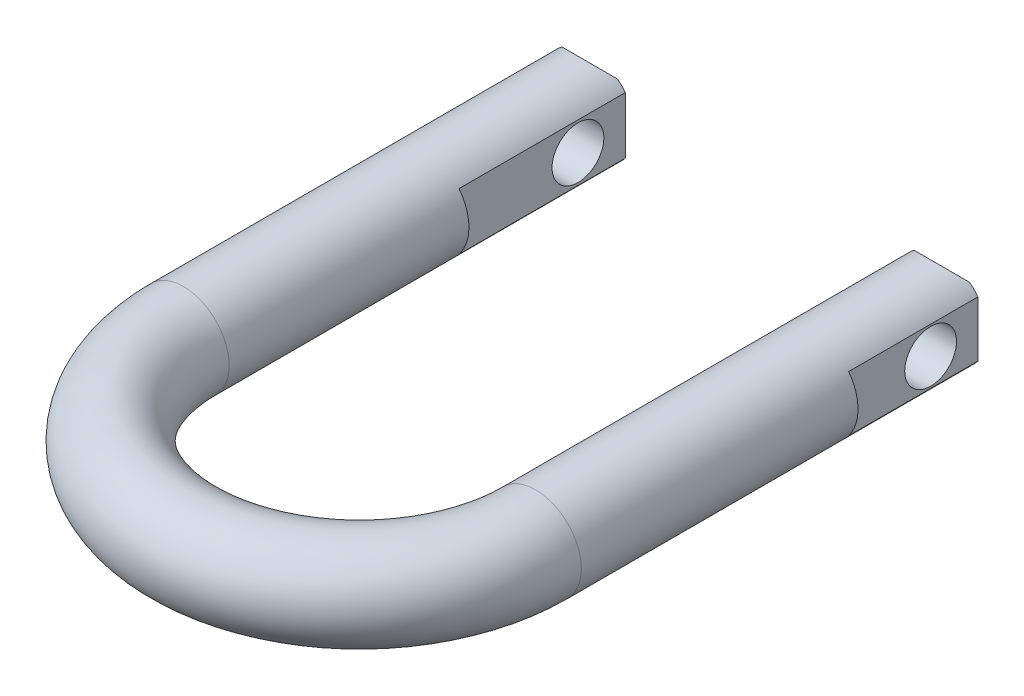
ISO-10303-21;
HEADER;
FILE_DESCRIPTION(('STEP AP214'),'2;1');
FILE_NAME('part.step','',(''),(''),'','','');
FILE_SCHEMA(('AUTOMOTIVE_DESIGN { 1 0 10303 214 1 1 1 1 }'));
ENDSEC;
DATA;
#1=APPLICATION_CONTEXT('core data for automotive mechanical design processes');
#2=APPLICATION_PROTOCOL_DEFINITION('international standard','automotive_design',2000,#1);
#3=PRODUCT_CONTEXT('',#1,'mechanical');
#4=PRODUCT('Part','Part','',(#3));
#5=PRODUCT_RELATED_PRODUCT_CATEGORY('part','',(#4));
#6=PRODUCT_DEFINITION_FORMATION('','',#4);
#7=PRODUCT_DEFINITION_CONTEXT('part definition',#1,'design');
#8=PRODUCT_DEFINITION('design','',#6,#7);
#9=PRODUCT_DEFINITION_SHAPE('','',#8);
#10=(LENGTH_UNIT() NAMED_UNIT(*) SI_UNIT(.MILLI.,.METRE.));
#11=(NAMED_UNIT(*) PLANE_ANGLE_UNIT() SI_UNIT($,.RADIAN.));
#12=(NAMED_UNIT(*) SI_UNIT($,.STERADIAN.) SOLID_ANGLE_UNIT());
#13=UNCERTAINTY_MEASURE_WITH_UNIT(LENGTH_MEASURE(1.E-05),#10,'distance_accuracy_value','');
#14=(GEOMETRIC_REPRESENTATION_CONTEXT(3) GLOBAL_UNCERTAINTY_ASSIGNED_CONTEXT((#13)) GLOBAL_UNIT_ASSIGNED_CONTEXT((#10,
#11,#12)) REPRESENTATION_CONTEXT('',''));
#15=CARTESIAN_POINT('',(0.,0.,0.));
#16=DIRECTION('',(0.,0.,1.));
#17=DIRECTION('',(1.,0.,0.));
#18=AXIS2_PLACEMENT_3D('',#15,#16,#17);
#19=CARTESIAN_POINT('',(48.26,0.,0.));
#20=DIRECTION('',(1.,0.,0.));
#21=DIRECTION('',(0.,0.,-1.));
#22=AXIS2_PLACEMENT_3D('',#19,#20,#21);
#23=CYLINDRICAL_SURFACE('',#22,8.9);
#24=CARTESIAN_POINT('',(73.0000000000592,0.,0.));
#25=DIRECTION('',(-1.,0.,0.));
#26=DIRECTION('',(0.,0.,1.));
#27=AXIS2_PLACEMENT_3D('',#24,#25,#26);
#28=CIRCLE('',#27,8.9);
#29=CARTESIAN_POINT('',(73.0000000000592,0.,8.9));
#30=VERTEX_POINT('',#29);
#31=EDGE_CURVE('E406',#30,#30,#28,.T.);
#32=ORIENTED_EDGE('',*,*,#31,.F.);
#33=EDGE_LOOP('',(#32));
#34=FACE_BOUND('',#33,.T.);
#35=CARTESIAN_POINT('',(48.26,0.,0.));
#36=DIRECTION('',(1.,0.,0.));
#37=DIRECTION('',(0.,0.,-1.));
#38=AXIS2_PLACEMENT_3D('',#35,#36,#37);
#39=CIRCLE('',#38,8.9);
#40=CARTESIAN_POINT('',(48.26,0.,-8.90000000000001));
#41=VERTEX_POINT('',#40);
#42=EDGE_CURVE('E18',#41,#41,#39,.T.);
#43=ORIENTED_EDGE('',*,*,#42,.F.);
#44=EDGE_LOOP('',(#43));
#45=FACE_BOUND('',#44,.T.);
#46=ADVANCED_FACE('F14',(#34,#45),#23,.F.);
#47=CARTESIAN_POINT('',(-48.26,0.,0.));
#48=DIRECTION('',(-1.,0.,0.));
#49=DIRECTION('',(0.,0.,1.));
#50=AXIS2_PLACEMENT_3D('',#47,#48,#49);
#51=CYLINDRICAL_SURFACE('',#50,8.9);
#52=CARTESIAN_POINT('',(-48.26,0.,0.));
#53=DIRECTION('',(-1.,0.,0.));
#54=DIRECTION('',(0.,0.,1.));
#55=AXIS2_PLACEMENT_3D('',#52,#53,#54);
#56=CIRCLE('',#55,8.9);
#57=CARTESIAN_POINT('',(-48.26,0.,8.89999999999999));
#58=VERTEX_POINT('',#57);
#59=EDGE_CURVE('E129',#58,#58,#56,.F.);
#60=ORIENTED_EDGE('',*,*,#59,.T.);
#61=EDGE_LOOP('',(#60));
#62=FACE_BOUND('',#61,.T.);
#63=CARTESIAN_POINT('',(-73.0000000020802,0.,0.));
#64=DIRECTION('',(1.,0.,0.));
#65=DIRECTION('',(0.,0.,-1.));
#66=AXIS2_PLACEMENT_3D('',#63,#64,#65);
#67=CIRCLE('',#66,8.9);
#68=CARTESIAN_POINT('',(-73.0000000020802,0.,-8.9));
#69=VERTEX_POINT('',#68);
#70=EDGE_CURVE('E164',#69,#69,#67,.T.);
#71=ORIENTED_EDGE('',*,*,#70,.F.);
#72=EDGE_LOOP('',(#71));
#73=FACE_BOUND('',#72,.T.);
#74=ADVANCED_FACE('F255',(#62,#73),#51,.F.);
#75=CARTESIAN_POINT('',(50.876635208,15.71947121,-13.035327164));
#76=DIRECTION('',(0.,-0.707106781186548,0.707106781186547));
#77=DIRECTION('',(0.,-0.707106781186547,-0.707106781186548));
#78=AXIS2_PLACEMENT_3D('',#75,#76,#77);
#79=PLANE('',#78);
#80=CARTESIAN_POINT('',(60.55,0.,-28.754798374));
#81=DIRECTION('',(0.,-0.707106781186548,0.707106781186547));
#82=DIRECTION('',(0.,-0.707106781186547,-0.707106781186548));
#83=AXIS2_PLACEMENT_3D('',#80,#81,#82);
#84=ELLIPSE('',#83,22.2031529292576,15.7);
#85=CARTESIAN_POINT('',(50.9913391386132,12.454798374,-16.3));
#86=VERTEX_POINT('',#85);
#87=CARTESIAN_POINT('',(70.1086608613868,12.454798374,-16.3));
#88=VERTEX_POINT('',#87);
#89=EDGE_CURVE('E104',#86,#88,#84,.F.);
#90=ORIENTED_EDGE('',*,*,#89,.T.);
#91=DIRECTION('',(-1.,0.,0.));
#92=VECTOR('',#91,1.);
#93=CARTESIAN_POINT('',(60.63,12.454798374,-16.3));
#94=LINE('',#93,#92);
#95=EDGE_CURVE('E100',#88,#86,#94,.T.);
#96=ORIENTED_EDGE('',*,*,#95,.T.);
#97=EDGE_LOOP('',(#90,#96));
#98=FACE_BOUND('',#97,.T.);
#99=ADVANCED_FACE('F102',(#98),#79,.F.);
#100=CARTESIAN_POINT('',(-70.223364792,12.454798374,-16.3));
#101=DIRECTION('',(0.,0.707106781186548,-0.707106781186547));
#102=DIRECTION('',(0.,0.707106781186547,0.707106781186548));
#103=AXIS2_PLACEMENT_3D('',#100,#101,#102);
#104=PLANE('',#103);
#105=DIRECTION('',(1.,0.,0.));
#106=VECTOR('',#105,1.);
#107=CARTESIAN_POINT('',(-60.63,12.454798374,-16.3));
#108=LINE('',#107,#106);
#109=CARTESIAN_POINT('',(-70.1086608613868,12.454798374,-16.3));
#110=VERTEX_POINT('',#109);
#111=CARTESIAN_POINT('',(-50.9913391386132,12.454798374,-16.3));
#112=VERTEX_POINT('',#111);
#113=EDGE_CURVE('E136',#110,#112,#108,.T.);
#114=ORIENTED_EDGE('',*,*,#113,.F.);
#115=CARTESIAN_POINT('',(-60.55,0.,-28.754798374));
#116=DIRECTION('',(0.,0.707106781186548,-0.707106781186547));
#117=DIRECTION('',(0.,-0.707106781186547,-0.707106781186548));
#118=AXIS2_PLACEMENT_3D('',#115,#116,#117);
#119=ELLIPSE('',#118,22.2031529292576,15.7);
#120=EDGE_CURVE('E203',#110,#112,#119,.T.);
#121=ORIENTED_EDGE('',*,*,#120,.T.);
#122=EDGE_LOOP('',(#114,#121));
#123=FACE_BOUND('',#122,.T.);
#124=ADVANCED_FACE('F218',(#123),#104,.T.);
#125=CARTESIAN_POINT('',(73.,-9.679688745,28.2));
#126=DIRECTION('',(0.,0.,-1.));
#127=DIRECTION('',(0.,1.,0.));
#128=AXIS2_PLACEMENT_3D('',#125,#126,#127);
#129=PLANE('',#128);
#130=DIRECTION('',(0.,1.,0.));
#131=VECTOR('',#130,1.);
#132=CARTESIAN_POINT('',(73.,0.,28.2));
#133=LINE('',#132,#131);
#134=CARTESIAN_POINT('',(73.0000000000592,-9.56490982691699,28.199999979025));
#135=VERTEX_POINT('',#134);
#136=CARTESIAN_POINT('',(72.9999999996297,9.56490982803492,28.199999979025));
#137=VERTEX_POINT('',#136);
#138=EDGE_CURVE('E161',#135,#137,#133,.T.);
#139=ORIENTED_EDGE('',*,*,#138,.T.);
#140=CARTESIAN_POINT('',(60.55,0.,28.19999995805));
#141=DIRECTION('',(0.,0.,-1.));
#142=DIRECTION('',(-1.,0.,0.));
#143=AXIS2_PLACEMENT_3D('',#140,#141,#142);
#144=CIRCLE('',#143,15.7);
#145=EDGE_CURVE('E160',#137,#135,#144,.T.);
#146=ORIENTED_EDGE('',*,*,#145,.T.);
#147=EDGE_LOOP('',(#139,#146));
#148=FACE_BOUND('',#147,.T.);
#149=ADVANCED_FACE('F258',(#148),#129,.T.);
#150=CARTESIAN_POINT('',(73.,9.564909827,-16.3));
#151=DIRECTION('',(-1.,0.,0.));
#152=DIRECTION('',(0.,-1.,0.));
#153=AXIS2_PLACEMENT_3D('',#150,#151,#152);
#154=PLANE('',#153);
#155=DIRECTION('',(0.,1.,0.));
#156=VECTOR('',#155,1.);
#157=CARTESIAN_POINT('',(73.,0.,-16.3));
#158=LINE('',#157,#156);
#159=CARTESIAN_POINT('',(73.0000000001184,-9.56490982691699,-16.3));
#160=VERTEX_POINT('',#159);
#161=CARTESIAN_POINT('',(72.9999999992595,9.56490982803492,-16.3));
#162=VERTEX_POINT('',#161);
#163=EDGE_CURVE('E109',#160,#162,#158,.T.);
#164=ORIENTED_EDGE('',*,*,#163,.T.);
#165=DIRECTION('',(0.,0.,-1.));
#166=VECTOR('',#165,1.);
#167=CARTESIAN_POINT('',(72.999999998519,9.5649098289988,53.525));
#168=LINE('',#167,#166);
#169=EDGE_CURVE('E126',#162,#137,#168,.F.);
#170=ORIENTED_EDGE('',*,*,#169,.T.);
#171=ORIENTED_EDGE('',*,*,#138,.F.);
#172=DIRECTION('',(0.,0.,1.));
#173=VECTOR('',#172,1.);
#174=CARTESIAN_POINT('',(73.0000000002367,-9.56490982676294,53.525));
#175=LINE('',#174,#173);
#176=EDGE_CURVE('E157',#135,#160,#175,.F.);
#177=ORIENTED_EDGE('',*,*,#176,.T.);
#178=EDGE_LOOP('',(#164,#170,#171,#177));
#179=FACE_BOUND('',#178,.T.);
#180=ORIENTED_EDGE('',*,*,#31,.T.);
#181=EDGE_LOOP('',(#180));
#182=FACE_BOUND('',#181,.T.);
#183=ADVANCED_FACE('F261',(#179,#182),#154,.F.);
#184=CARTESIAN_POINT('',(50.876635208,-15.71947121,-13.035327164));
#185=DIRECTION('',(0.,-0.707106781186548,-0.707106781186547));
#186=DIRECTION('',(0.,0.707106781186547,-0.707106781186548));
#187=AXIS2_PLACEMENT_3D('',#184,#185,#186);
#188=PLANE('',#187);
#189=CARTESIAN_POINT('',(60.55,0.,-28.754798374));
#190=DIRECTION('',(0.,-0.707106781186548,-0.707106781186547));
#191=DIRECTION('',(0.,0.707106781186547,-0.707106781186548));
#192=AXIS2_PLACEMENT_3D('',#189,#190,#191);
#193=ELLIPSE('',#192,22.2031529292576,15.7);
#194=CARTESIAN_POINT('',(70.1086608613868,-12.454798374,-16.3));
#195=VERTEX_POINT('',#194);
#196=CARTESIAN_POINT('',(50.9913391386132,-12.454798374,-16.3));
#197=VERTEX_POINT('',#196);
#198=EDGE_CURVE('E195',#195,#197,#193,.T.);
#199=ORIENTED_EDGE('',*,*,#198,.T.);
#200=DIRECTION('',(1.,0.,0.));
#201=VECTOR('',#200,1.);
#202=CARTESIAN_POINT('',(60.63,-12.454798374,-16.3));
#203=LINE('',#202,#201);
#204=EDGE_CURVE('E108',#197,#195,#203,.T.);
#205=ORIENTED_EDGE('',*,*,#204,.T.);
#206=EDGE_LOOP('',(#199,#205));
#207=FACE_BOUND('',#206,.T.);
#208=ADVANCED_FACE('F265',(#207),#188,.T.);
#209=CARTESIAN_POINT('',(48.26,12.454798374,-16.3));
#210=DIRECTION('',(0.,0.,1.));
#211=DIRECTION('',(0.,-1.,0.));
#212=AXIS2_PLACEMENT_3D('',#209,#210,#211);
#213=PLANE('',#212);
#214=CARTESIAN_POINT('',(60.55,0.,-16.3));
#215=DIRECTION('',(0.,0.,-1.));
#216=DIRECTION('',(-1.,0.,0.));
#217=AXIS2_PLACEMENT_3D('',#214,#215,#216);
#218=CIRCLE('',#217,15.7);
#219=CARTESIAN_POINT('',(48.260000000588,-9.76964175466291,-16.3));
#220=VERTEX_POINT('',#219);
#221=EDGE_CURVE('E155',#197,#220,#218,.T.);
#222=ORIENTED_EDGE('',*,*,#221,.T.);
#223=DIRECTION('',(0.,-1.,0.));
#224=VECTOR('',#223,1.);
#225=CARTESIAN_POINT('',(48.26,0.,-16.3));
#226=LINE('',#225,#224);
#227=CARTESIAN_POINT('',(48.2599999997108,9.76964175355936,-16.3));
#228=VERTEX_POINT('',#227);
#229=EDGE_CURVE('E115',#228,#220,#226,.T.);
#230=ORIENTED_EDGE('',*,*,#229,.F.);
#231=CARTESIAN_POINT('',(60.55,0.,-16.3));
#232=DIRECTION('',(0.,0.,-1.));
#233=DIRECTION('',(-1.,0.,0.));
#234=AXIS2_PLACEMENT_3D('',#231,#232,#233);
#235=CIRCLE('',#234,15.7);
#236=EDGE_CURVE('E112',#228,#86,#235,.T.);
#237=ORIENTED_EDGE('',*,*,#236,.T.);
#238=ORIENTED_EDGE('',*,*,#95,.F.);
#239=CARTESIAN_POINT('',(60.55,0.,-16.3));
#240=DIRECTION('',(0.,0.,-1.));
#241=DIRECTION('',(-1.,0.,0.));
#242=AXIS2_PLACEMENT_3D('',#239,#240,#241);
#243=CIRCLE('',#242,15.7);
#244=EDGE_CURVE('E124',#88,#162,#243,.T.);
#245=ORIENTED_EDGE('',*,*,#244,.T.);
#246=ORIENTED_EDGE('',*,*,#163,.F.);
#247=CARTESIAN_POINT('',(60.55,0.,-16.3));
#248=DIRECTION('',(0.,0.,-1.));
#249=DIRECTION('',(-1.,0.,0.));
#250=AXIS2_PLACEMENT_3D('',#247,#248,#249);
#251=CIRCLE('',#250,15.7);
#252=EDGE_CURVE('E159',#160,#195,#251,.T.);
#253=ORIENTED_EDGE('',*,*,#252,.T.);
#254=ORIENTED_EDGE('',*,*,#204,.F.);
#255=EDGE_LOOP('',(#222,#230,#237,#238,#245,#246,#253,#254));
#256=FACE_BOUND('',#255,.T.);
#257=ADVANCED_FACE('F113',(#256),#213,.F.);
#258=CARTESIAN_POINT('',(48.26,9.769641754,-16.3));
#259=DIRECTION('',(-1.,0.,0.));
#260=DIRECTION('',(0.,-1.,0.));
#261=AXIS2_PLACEMENT_3D('',#258,#259,#260);
#262=PLANE('',#261);
#263=ORIENTED_EDGE('',*,*,#42,.T.);
#264=EDGE_LOOP('',(#263));
#265=FACE_BOUND('',#264,.T.);
#266=DIRECTION('',(0.,0.,-1.));
#267=VECTOR('',#266,1.);
#268=CARTESIAN_POINT('',(48.260000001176,-9.7696417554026,53.525));
#269=LINE('',#268,#267);
#270=CARTESIAN_POINT('',(48.260000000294,-9.76964175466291,40.899999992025));
#271=VERTEX_POINT('',#270);
#272=EDGE_CURVE('E152',#220,#271,#269,.F.);
#273=ORIENTED_EDGE('',*,*,#272,.T.);
#274=DIRECTION('',(0.,1.,0.));
#275=VECTOR('',#274,1.);
#276=CARTESIAN_POINT('',(48.26,0.,40.9));
#277=LINE('',#276,#275);
#278=CARTESIAN_POINT('',(48.2599999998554,9.76964175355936,40.899999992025));
#279=VERTEX_POINT('',#278);
#280=EDGE_CURVE('E139',#271,#279,#277,.T.);
#281=ORIENTED_EDGE('',*,*,#280,.T.);
#282=DIRECTION('',(0.,0.,1.));
#283=VECTOR('',#282,1.);
#284=CARTESIAN_POINT('',(48.2599999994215,9.76964175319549,53.525));
#285=LINE('',#284,#283);
#286=EDGE_CURVE('E119',#279,#228,#285,.F.);
#287=ORIENTED_EDGE('',*,*,#286,.T.);
#288=ORIENTED_EDGE('',*,*,#229,.T.);
#289=EDGE_LOOP('',(#273,#281,#287,#288));
#290=FACE_BOUND('',#289,.T.);
#291=ADVANCED_FACE('F272',(#265,#290),#262,.T.);
#292=CARTESIAN_POINT('',(44.82954,9.886877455,40.9));
#293=DIRECTION('',(0.,0.,1.));
#294=DIRECTION('',(0.,-1.,0.));
#295=AXIS2_PLACEMENT_3D('',#292,#293,#294);
#296=PLANE('',#295);
#297=CARTESIAN_POINT('',(60.55,0.,40.89999998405));
#298=DIRECTION('',(0.,0.,-1.));
#299=DIRECTION('',(-1.,0.,0.));
#300=AXIS2_PLACEMENT_3D('',#297,#298,#299);
#301=CIRCLE('',#300,15.7);
#302=EDGE_CURVE('E154',#271,#279,#301,.T.);
#303=ORIENTED_EDGE('',*,*,#302,.T.);
#304=ORIENTED_EDGE('',*,*,#280,.F.);
#305=EDGE_LOOP('',(#303,#304));
#306=FACE_BOUND('',#305,.T.);
#307=ADVANCED_FACE('F275',(#306),#296,.F.);
#308=CARTESIAN_POINT('',(-48.26,-9.886877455,40.9));
#309=DIRECTION('',(0.,0.,-1.));
#310=DIRECTION('',(0.,1.,0.));
#311=AXIS2_PLACEMENT_3D('',#308,#309,#310);
#312=PLANE('',#311);
#313=DIRECTION('',(0.,1.,0.));
#314=VECTOR('',#313,1.);
#315=CARTESIAN_POINT('',(-48.26,0.,40.9));
#316=LINE('',#315,#314);
#317=CARTESIAN_POINT('',(-48.2599999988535,-9.76964175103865,40.899999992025));
#318=VERTEX_POINT('',#317);
#319=CARTESIAN_POINT('',(-48.2599999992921,9.76964175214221,40.899999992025));
#320=VERTEX_POINT('',#319);
#321=EDGE_CURVE('E132',#318,#320,#316,.T.);
#322=ORIENTED_EDGE('',*,*,#321,.T.);
#323=CARTESIAN_POINT('',(-60.55,0.,40.89999998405));
#324=DIRECTION('',(0.,0.,-1.));
#325=DIRECTION('',(-1.,0.,0.));
#326=AXIS2_PLACEMENT_3D('',#323,#324,#325);
#327=CIRCLE('',#326,15.7);
#328=EDGE_CURVE('E190',#320,#318,#327,.T.);
#329=ORIENTED_EDGE('',*,*,#328,.T.);
#330=EDGE_LOOP('',(#322,#329));
#331=FACE_BOUND('',#330,.T.);
#332=ADVANCED_FACE('F279',(#331),#312,.T.);
#333=CARTESIAN_POINT('',(-48.26,9.769641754,-16.3));
#334=DIRECTION('',(-1.,0.,0.));
#335=DIRECTION('',(0.,-1.,0.));
#336=AXIS2_PLACEMENT_3D('',#333,#334,#335);
#337=PLANE('',#336);
#338=ORIENTED_EDGE('',*,*,#59,.F.);
#339=EDGE_LOOP('',(#338));
#340=FACE_BOUND('',#339,.T.);
#341=ORIENTED_EDGE('',*,*,#321,.F.);
#342=DIRECTION('',(0.,0.,1.));
#343=VECTOR('',#342,1.);
#344=CARTESIAN_POINT('',(-48.2599999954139,-9.76964174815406,53.525));
#345=LINE('',#344,#343);
#346=CARTESIAN_POINT('',(-48.259999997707,-9.76964175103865,-16.3));
#347=VERTEX_POINT('',#346);
#348=EDGE_CURVE('E147',#318,#347,#345,.F.);
#349=ORIENTED_EDGE('',*,*,#348,.T.);
#350=DIRECTION('',(0.,-1.,0.));
#351=VECTOR('',#350,1.);
#352=CARTESIAN_POINT('',(-48.26,0.,-16.3));
#353=LINE('',#352,#351);
#354=CARTESIAN_POINT('',(-48.2599999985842,9.76964175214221,-16.3));
#355=VERTEX_POINT('',#354);
#356=EDGE_CURVE('E219',#355,#347,#353,.T.);
#357=ORIENTED_EDGE('',*,*,#356,.F.);
#358=DIRECTION('',(0.,0.,-1.));
#359=VECTOR('',#358,1.);
#360=CARTESIAN_POINT('',(-48.2599999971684,9.76964175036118,53.525));
#361=LINE('',#360,#359);
#362=EDGE_CURVE('E170',#355,#320,#361,.F.);
#363=ORIENTED_EDGE('',*,*,#362,.T.);
#364=EDGE_LOOP('',(#341,#349,#357,#363));
#365=FACE_BOUND('',#364,.T.);
#366=ADVANCED_FACE('F283',(#340,#365),#337,.F.);
#367=CARTESIAN_POINT('',(-70.223364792,-12.454798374,-16.3));
#368=DIRECTION('',(0.,0.707106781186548,0.707106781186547));
#369=DIRECTION('',(0.,-0.707106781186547,0.707106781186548));
#370=AXIS2_PLACEMENT_3D('',#367,#368,#369);
#371=PLANE('',#370);
#372=DIRECTION('',(-1.,0.,0.));
#373=VECTOR('',#372,1.);
#374=CARTESIAN_POINT('',(-60.63,-12.454798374,-16.3));
#375=LINE('',#374,#373);
#376=CARTESIAN_POINT('',(-50.9913391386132,-12.454798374,-16.3));
#377=VERTEX_POINT('',#376);
#378=CARTESIAN_POINT('',(-70.1086608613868,-12.454798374,-16.3));
#379=VERTEX_POINT('',#378);
#380=EDGE_CURVE('E131',#377,#379,#375,.T.);
#381=ORIENTED_EDGE('',*,*,#380,.F.);
#382=CARTESIAN_POINT('',(-60.55,0.,-28.754798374));
#383=DIRECTION('',(0.,0.707106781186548,0.707106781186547));
#384=DIRECTION('',(0.,0.707106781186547,-0.707106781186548));
#385=AXIS2_PLACEMENT_3D('',#382,#383,#384);
#386=ELLIPSE('',#385,22.2031529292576,15.7);
#387=EDGE_CURVE('E185',#377,#379,#386,.F.);
#388=ORIENTED_EDGE('',*,*,#387,.T.);
#389=EDGE_LOOP('',(#381,#388));
#390=FACE_BOUND('',#389,.T.);
#391=ADVANCED_FACE('F286',(#390),#371,.F.);
#392=CARTESIAN_POINT('',(-48.26,12.454798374,-16.3));
#393=DIRECTION('',(0.,0.,-1.));
#394=DIRECTION('',(0.,-1.,0.));
#395=AXIS2_PLACEMENT_3D('',#392,#393,#394);
#396=PLANE('',#395);
#397=ORIENTED_EDGE('',*,*,#356,.T.);
#398=CARTESIAN_POINT('',(-60.55,0.,-16.3));
#399=DIRECTION('',(0.,0.,-1.));
#400=DIRECTION('',(-1.,0.,0.));
#401=AXIS2_PLACEMENT_3D('',#398,#399,#400);
#402=CIRCLE('',#401,15.7);
#403=EDGE_CURVE('E187',#347,#377,#402,.T.);
#404=ORIENTED_EDGE('',*,*,#403,.T.);
#405=ORIENTED_EDGE('',*,*,#380,.T.);
#406=CARTESIAN_POINT('',(-60.55,0.,-16.3));
#407=DIRECTION('',(0.,0.,-1.));
#408=DIRECTION('',(-1.,0.,0.));
#409=AXIS2_PLACEMENT_3D('',#406,#407,#408);
#410=CIRCLE('',#409,15.7);
#411=CARTESIAN_POINT('',(-73.0000000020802,-9.56490982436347,-16.3));
#412=VERTEX_POINT('',#411);
#413=EDGE_CURVE('E182',#379,#412,#410,.T.);
#414=ORIENTED_EDGE('',*,*,#413,.T.);
#415=DIRECTION('',(0.,-1.,0.));
#416=VECTOR('',#415,1.);
#417=CARTESIAN_POINT('',(-73.,0.,-16.3));
#418=LINE('',#417,#416);
#419=CARTESIAN_POINT('',(-72.9999999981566,9.56490982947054,-16.3));
#420=VERTEX_POINT('',#419);
#421=EDGE_CURVE('E212',#420,#412,#418,.T.);
#422=ORIENTED_EDGE('',*,*,#421,.F.);
#423=CARTESIAN_POINT('',(-60.55,0.,-16.3));
#424=DIRECTION('',(0.,0.,-1.));
#425=DIRECTION('',(-1.,0.,0.));
#426=AXIS2_PLACEMENT_3D('',#423,#424,#425);
#427=CIRCLE('',#426,15.7);
#428=EDGE_CURVE('E176',#420,#110,#427,.T.);
#429=ORIENTED_EDGE('',*,*,#428,.T.);
#430=ORIENTED_EDGE('',*,*,#113,.T.);
#431=CARTESIAN_POINT('',(-60.55,0.,-16.3));
#432=DIRECTION('',(0.,0.,-1.));
#433=DIRECTION('',(-1.,0.,0.));
#434=AXIS2_PLACEMENT_3D('',#431,#432,#433);
#435=CIRCLE('',#434,15.7);
#436=EDGE_CURVE('E172',#112,#355,#435,.T.);
#437=ORIENTED_EDGE('',*,*,#436,.T.);
#438=EDGE_LOOP('',(#397,#404,#405,#414,#422,#429,#430,#437));
#439=FACE_BOUND('',#438,.T.);
#440=ADVANCED_FACE('F210',(#439),#396,.T.);
#441=CARTESIAN_POINT('',(-73.,9.564909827,5.49686671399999));
#442=DIRECTION('',(-1.,0.,0.));
#443=DIRECTION('',(0.,-1.,0.));
#444=AXIS2_PLACEMENT_3D('',#441,#442,#443);
#445=PLANE('',#444);
#446=DIRECTION('',(0.,1.,0.));
#447=VECTOR('',#446,1.);
#448=CARTESIAN_POINT('',(-73.,0.,28.2));
#449=LINE('',#448,#447);
#450=CARTESIAN_POINT('',(-73.0000000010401,-9.56490982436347,28.199999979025));
#451=VERTEX_POINT('',#450);
#452=CARTESIAN_POINT('',(-72.9999999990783,9.56490982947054,28.199999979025));
#453=VERTEX_POINT('',#452);
#454=EDGE_CURVE('E179',#451,#453,#449,.T.);
#455=ORIENTED_EDGE('',*,*,#454,.T.);
#456=DIRECTION('',(0.,0.,1.));
#457=VECTOR('',#456,1.);
#458=CARTESIAN_POINT('',(-72.9999999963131,9.56490983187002,53.525));
#459=LINE('',#458,#457);
#460=EDGE_CURVE('E173',#453,#420,#459,.F.);
#461=ORIENTED_EDGE('',*,*,#460,.T.);
#462=ORIENTED_EDGE('',*,*,#421,.T.);
#463=DIRECTION('',(0.,0.,-1.));
#464=VECTOR('',#463,1.);
#465=CARTESIAN_POINT('',(-73.0000000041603,-9.56490982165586,53.525));
#466=LINE('',#465,#464);
#467=EDGE_CURVE('E33',#412,#451,#466,.F.);
#468=ORIENTED_EDGE('',*,*,#467,.T.);
#469=EDGE_LOOP('',(#455,#461,#462,#468));
#470=FACE_BOUND('',#469,.T.);
#471=ORIENTED_EDGE('',*,*,#70,.T.);
#472=EDGE_LOOP('',(#471));
#473=FACE_BOUND('',#472,.T.);
#474=ADVANCED_FACE('F224',(#470,#473),#445,.T.);
#475=CARTESIAN_POINT('',(-76.2695,9.679688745,28.2));
#476=DIRECTION('',(0.,0.,1.));
#477=DIRECTION('',(0.,-1.,0.));
#478=AXIS2_PLACEMENT_3D('',#475,#476,#477);
#479=PLANE('',#478);
#480=CARTESIAN_POINT('',(-60.55,0.,28.19999995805));
#481=DIRECTION('',(0.,0.,-1.));
#482=DIRECTION('',(-1.,0.,0.));
#483=AXIS2_PLACEMENT_3D('',#480,#481,#482);
#484=CIRCLE('',#483,15.7);
#485=EDGE_CURVE('E167',#451,#453,#484,.T.);
#486=ORIENTED_EDGE('',*,*,#485,.T.);
#487=ORIENTED_EDGE('',*,*,#454,.F.);
#488=EDGE_LOOP('',(#486,#487));
#489=FACE_BOUND('',#488,.T.);
#490=ADVANCED_FACE('F228',(#489),#479,.F.);
#491=CARTESIAN_POINT('',(60.55,0.,123.35));
#492=DIRECTION('',(0.,0.,-1.));
#493=DIRECTION('',(-1.,0.,0.));
#494=AXIS2_PLACEMENT_3D('',#491,#492,#493);
#495=CYLINDRICAL_SURFACE('',#494,15.7);
#496=ORIENTED_EDGE('',*,*,#145,.F.);
#497=ORIENTED_EDGE('',*,*,#169,.F.);
#498=ORIENTED_EDGE('',*,*,#244,.F.);
#499=ORIENTED_EDGE('',*,*,#89,.F.);
#500=ORIENTED_EDGE('',*,*,#236,.F.);
#501=ORIENTED_EDGE('',*,*,#286,.F.);
#502=ORIENTED_EDGE('',*,*,#302,.F.);
#503=ORIENTED_EDGE('',*,*,#272,.F.);
#504=ORIENTED_EDGE('',*,*,#221,.F.);
#505=ORIENTED_EDGE('',*,*,#198,.F.);
#506=ORIENTED_EDGE('',*,*,#252,.F.);
#507=ORIENTED_EDGE('',*,*,#176,.F.);
#508=EDGE_LOOP('',(#496,#497,#498,#499,#500,#501,#502,#503,#504,#505,#506,#507));
#509=FACE_BOUND('',#508,.T.);
#510=CARTESIAN_POINT('',(60.55,0.,123.35));
#511=DIRECTION('',(0.,0.,1.));
#512=DIRECTION('',(1.,0.,0.));
#513=AXIS2_PLACEMENT_3D('',#510,#511,#512);
#514=CIRCLE('',#513,15.7);
#515=CARTESIAN_POINT('',(76.25,0.,123.35));
#516=VERTEX_POINT('',#515);
#517=EDGE_CURVE('E24',#516,#516,#514,.T.);
#518=ORIENTED_EDGE('',*,*,#517,.F.);
#519=EDGE_LOOP('',(#518));
#520=FACE_BOUND('',#519,.T.);
#521=ADVANCED_FACE('F122',(#509,#520),#495,.T.);
#522=CARTESIAN_POINT('',(-60.55,0.,123.35));
#523=DIRECTION('',(0.,0.,-1.));
#524=DIRECTION('',(-1.,0.,0.));
#525=AXIS2_PLACEMENT_3D('',#522,#523,#524);
#526=CYLINDRICAL_SURFACE('',#525,15.7);
#527=ORIENTED_EDGE('',*,*,#328,.F.);
#528=ORIENTED_EDGE('',*,*,#362,.F.);
#529=ORIENTED_EDGE('',*,*,#436,.F.);
#530=ORIENTED_EDGE('',*,*,#120,.F.);
#531=ORIENTED_EDGE('',*,*,#428,.F.);
#532=ORIENTED_EDGE('',*,*,#460,.F.);
#533=ORIENTED_EDGE('',*,*,#485,.F.);
#534=ORIENTED_EDGE('',*,*,#467,.F.);
#535=ORIENTED_EDGE('',*,*,#413,.F.);
#536=ORIENTED_EDGE('',*,*,#387,.F.);
#537=ORIENTED_EDGE('',*,*,#403,.F.);
#538=ORIENTED_EDGE('',*,*,#348,.F.);
#539=EDGE_LOOP('',(#527,#528,#529,#530,#531,#532,#533,#534,#535,#536,#537,#538));
#540=FACE_BOUND('',#539,.T.);
#541=CARTESIAN_POINT('',(-60.55,0.,123.35));
#542=DIRECTION('',(0.,0.,1.));
#543=DIRECTION('',(1.,0.,0.));
#544=AXIS2_PLACEMENT_3D('',#541,#542,#543);
#545=CIRCLE('',#544,15.7);
#546=CARTESIAN_POINT('',(-44.85,0.,123.35));
#547=VERTEX_POINT('',#546);
#548=EDGE_CURVE('E9',#547,#547,#545,.T.);
#549=ORIENTED_EDGE('',*,*,#548,.F.);
#550=EDGE_LOOP('',(#549));
#551=FACE_BOUND('',#550,.T.);
#552=ADVANCED_FACE('F214',(#540,#551),#526,.T.);
#553=CARTESIAN_POINT('',(0.,0.,123.35));
#554=DIRECTION('',(0.,-1.,0.));
#555=DIRECTION('',(0.,0.,-1.));
#556=AXIS2_PLACEMENT_3D('',#553,#554,#555);
#557=TOROIDAL_SURFACE('',#556,60.55,15.7);
#558=ORIENTED_EDGE('',*,*,#548,.T.);
#559=EDGE_LOOP('',(#558));
#560=FACE_BOUND('',#559,.T.);
#561=ORIENTED_EDGE('',*,*,#517,.T.);
#562=EDGE_LOOP('',(#561));
#563=FACE_BOUND('',#562,.T.);
#564=ADVANCED_FACE('F16',(#560,#563),#557,.T.);
#565=CLOSED_SHELL('',(#46,#74,#99,#124,#149,#183,#208,#257,#291,#307,#332,#366,#391,#440,#474,
#490,#521,#552,#564));
#566=MANIFOLD_SOLID_BREP('B1',#565);
#567=ADVANCED_BREP_SHAPE_REPRESENTATION('',(#18,#566),#14);
#568=SHAPE_DEFINITION_REPRESENTATION(#9,#567);
ENDSEC;
END-ISO-10303-21;
